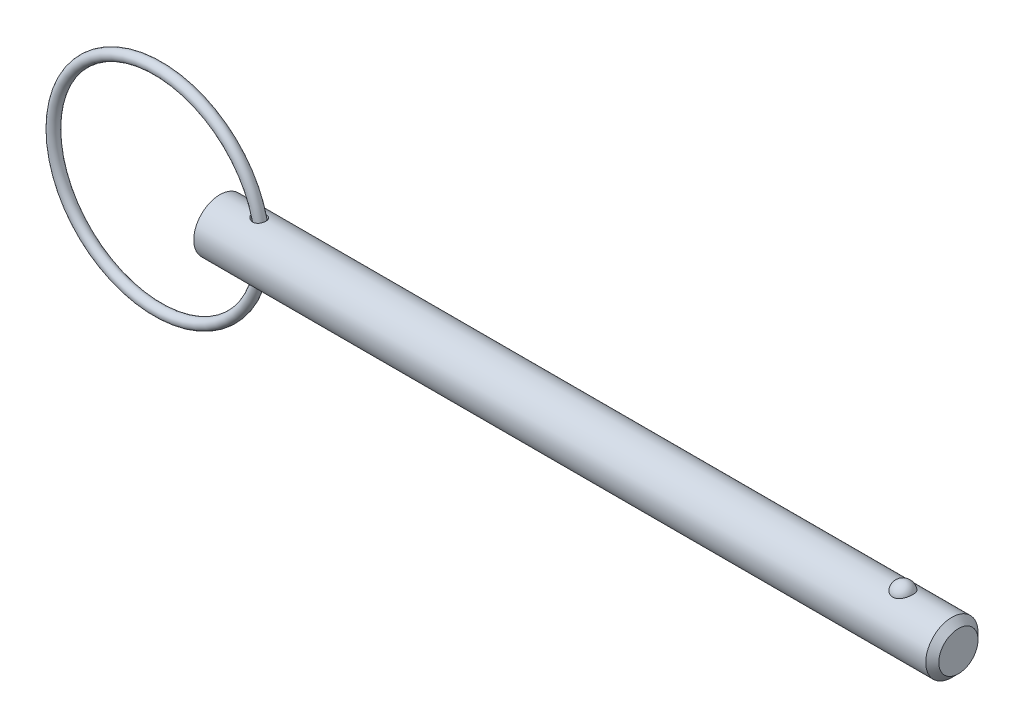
ISO-10303-21;
HEADER;
FILE_DESCRIPTION(('STEP AP214'),'2;1');
FILE_NAME('part.step','',(''),(''),'','','');
FILE_SCHEMA(('AUTOMOTIVE_DESIGN { 1 0 10303 214 1 1 1 1 }'));
ENDSEC;
DATA;
#1=APPLICATION_CONTEXT('core data for automotive mechanical design processes');
#2=APPLICATION_PROTOCOL_DEFINITION('international standard','automotive_design',2000,#1);
#3=PRODUCT_CONTEXT('',#1,'mechanical');
#4=PRODUCT('Part','Part','',(#3));
#5=PRODUCT_RELATED_PRODUCT_CATEGORY('part','',(#4));
#6=PRODUCT_DEFINITION_FORMATION('','',#4);
#7=PRODUCT_DEFINITION_CONTEXT('part definition',#1,'design');
#8=PRODUCT_DEFINITION('design','',#6,#7);
#9=PRODUCT_DEFINITION_SHAPE('','',#8);
#10=(LENGTH_UNIT() NAMED_UNIT(*) SI_UNIT(.MILLI.,.METRE.));
#11=(NAMED_UNIT(*) PLANE_ANGLE_UNIT() SI_UNIT($,.RADIAN.));
#12=(NAMED_UNIT(*) SI_UNIT($,.STERADIAN.) SOLID_ANGLE_UNIT());
#13=UNCERTAINTY_MEASURE_WITH_UNIT(LENGTH_MEASURE(1.E-05),#10,'distance_accuracy_value','');
#14=(GEOMETRIC_REPRESENTATION_CONTEXT(3) GLOBAL_UNCERTAINTY_ASSIGNED_CONTEXT((#13)) GLOBAL_UNIT_ASSIGNED_CONTEXT((#10,
#11,#12)) REPRESENTATION_CONTEXT('',''));
#15=CARTESIAN_POINT('',(0.,0.,0.));
#16=DIRECTION('',(0.,0.,1.));
#17=DIRECTION('',(1.,0.,0.));
#18=AXIS2_PLACEMENT_3D('',#15,#16,#17);
#19=CARTESIAN_POINT('',(-7.52490236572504,0.,0.));
#20=DIRECTION('',(0.,0.,1.));
#21=DIRECTION('',(1.,0.,0.));
#22=AXIS2_PLACEMENT_3D('',#19,#20,#21);
#23=TOROIDAL_SURFACE('',#22,12.7,0.635000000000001);
#24=CARTESIAN_POINT('',(5.81009763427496,0.,0.));
#25=VERTEX_POINT('',#24);
#26=VERTEX_LOOP('',#25);
#27=FACE_BOUND('',#26,.T.);
#28=ADVANCED_FACE('P0_F12',(#27),#23,.T.);
#29=CLOSED_SHELL('',(#28));
#30=MANIFOLD_SOLID_BREP('P0_B1',#29);
#31=CARTESIAN_POINT('',(0.,0.,0.));
#32=DIRECTION('',(1.,0.,0.));
#33=DIRECTION('',(0.,0.,-1.));
#34=AXIS2_PLACEMENT_3D('',#31,#32,#33);
#35=CYLINDRICAL_SURFACE('',#34,3.175);
#36=CARTESIAN_POINT('',(4.01221718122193,3.16142308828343,-0.293307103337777));
#37=CARTESIAN_POINT('',(4.03067993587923,3.15750982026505,-0.335477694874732));
#38=CARTESIAN_POINT('',(4.05297703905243,3.15289835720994,-0.375943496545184));
#39=CARTESIAN_POINT('',(4.10415276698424,3.14284099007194,-0.452407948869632));
#40=CARTESIAN_POINT('',(4.1330447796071,3.13739339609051,-0.488397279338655));
#41=CARTESIAN_POINT('',(4.19615348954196,3.12629932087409,-0.554988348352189));
#42=CARTESIAN_POINT('',(4.23034557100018,3.12065384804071,-0.585613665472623));
#43=CARTESIAN_POINT('',(4.3031328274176,3.10972452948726,-0.641123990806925));
#44=CARTESIAN_POINT('',(4.34172706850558,3.10444060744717,-0.666010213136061));
#45=CARTESIAN_POINT('',(4.42517725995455,3.09444053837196,-0.711079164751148));
#46=CARTESIAN_POINT('',(4.47028158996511,3.08978882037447,-0.730818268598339));
#47=CARTESIAN_POINT('',(4.56327045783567,3.08209858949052,-0.762602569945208));
#48=CARTESIAN_POINT('',(4.61115533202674,3.07906027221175,-0.774646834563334));
#49=CARTESIAN_POINT('',(4.70827322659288,3.0750396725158,-0.790458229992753));
#50=CARTESIAN_POINT('',(4.75750323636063,3.07405312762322,-0.79424252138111));
#51=CARTESIAN_POINT('',(4.85586074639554,3.07433427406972,-0.793155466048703));
#52=CARTESIAN_POINT('',(4.90498828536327,3.07560084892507,-0.788288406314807));
#53=CARTESIAN_POINT('',(4.99830385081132,3.08013122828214,-0.770385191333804));
#54=CARTESIAN_POINT('',(5.04260499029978,3.08325928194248,-0.757902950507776));
#55=CARTESIAN_POINT('',(5.1282462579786,3.09104671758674,-0.725486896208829));
#56=CARTESIAN_POINT('',(5.16958706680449,3.09570574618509,-0.705554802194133));
#57=CARTESIAN_POINT('',(5.24627719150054,3.10576748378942,-0.65981371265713));
#58=CARTESIAN_POINT('',(5.28181038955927,3.11112830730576,-0.634302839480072));
#59=CARTESIAN_POINT('',(5.34802604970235,3.12213947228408,-0.57766778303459));
#60=CARTESIAN_POINT('',(5.37870854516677,3.1277898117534,-0.546543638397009));
#61=CARTESIAN_POINT('',(5.43445707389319,3.13876145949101,-0.479533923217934));
#62=CARTESIAN_POINT('',(5.45951927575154,3.14408254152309,-0.443645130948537));
#63=CARTESIAN_POINT('',(5.50339935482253,3.15381660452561,-0.368122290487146));
#64=CARTESIAN_POINT('',(5.52221691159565,3.15822953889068,-0.328488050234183));
#65=CARTESIAN_POINT('',(5.55335622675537,3.16572312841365,-0.246075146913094));
#66=CARTESIAN_POINT('',(5.56559711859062,3.16878711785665,-0.203264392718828));
#67=CARTESIAN_POINT('',(5.58294807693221,3.17317503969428,-0.116135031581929));
#68=CARTESIAN_POINT('',(5.58805800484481,3.17449893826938,-0.0718163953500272));
#69=CARTESIAN_POINT('',(5.59103306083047,3.17526647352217,0.01723401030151));
#70=CARTESIAN_POINT('',(5.58887304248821,3.17470358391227,0.0619666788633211));
#71=CARTESIAN_POINT('',(5.57730300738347,3.17174350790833,0.15042284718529));
#72=CARTESIAN_POINT('',(5.56789286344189,3.16934628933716,0.1941463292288));
#73=CARTESIAN_POINT('',(5.54204285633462,3.16297605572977,0.27934466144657));
#74=CARTESIAN_POINT('',(5.52560272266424,3.15900298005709,0.320819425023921));
#75=CARTESIAN_POINT('',(5.4860820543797,3.14991364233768,0.400340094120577));
#76=CARTESIAN_POINT('',(5.46300145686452,3.14479736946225,0.438385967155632));
#77=CARTESIAN_POINT('',(5.41080575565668,3.1339965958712,0.509900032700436));
#78=CARTESIAN_POINT('',(5.3817004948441,3.12831302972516,0.54337554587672));
#79=CARTESIAN_POINT('',(5.31818122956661,3.11701107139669,0.604852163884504));
#80=CARTESIAN_POINT('',(5.2837678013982,3.11139267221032,0.632853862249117));
#81=CARTESIAN_POINT('',(5.21096127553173,3.10091904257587,0.682320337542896));
#82=CARTESIAN_POINT('',(5.1726139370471,3.09605639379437,0.703850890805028));
#83=CARTESIAN_POINT('',(5.09274050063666,3.08756769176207,0.740203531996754));
#84=CARTESIAN_POINT('',(5.05121474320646,3.08394150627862,0.755026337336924));
#85=CARTESIAN_POINT('',(4.96650658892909,3.07833156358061,0.777582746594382));
#86=CARTESIAN_POINT('',(4.92333841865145,3.07633606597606,0.785367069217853));
#87=CARTESIAN_POINT('',(4.83627503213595,3.07411756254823,0.794006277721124));
#88=CARTESIAN_POINT('',(4.79237971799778,3.07389479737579,0.794860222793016));
#89=CARTESIAN_POINT('',(4.70375644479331,3.0752087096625,0.789761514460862));
#90=CARTESIAN_POINT('',(4.65904075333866,3.07679607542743,0.783612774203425));
#91=CARTESIAN_POINT('',(4.57116325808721,3.08158486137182,0.764561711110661));
#92=CARTESIAN_POINT('',(4.52800197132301,3.08478681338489,0.751657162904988));
#93=CARTESIAN_POINT('',(4.44149370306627,3.09268658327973,0.718486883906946));
#94=CARTESIAN_POINT('',(4.39831651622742,3.0974680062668,0.697797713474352));
#95=CARTESIAN_POINT('',(4.31591226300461,3.10789270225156,0.649792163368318));
#96=CARTESIAN_POINT('',(4.27668695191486,3.11353635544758,0.622472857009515));
#97=CARTESIAN_POINT('',(4.20182407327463,3.1252888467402,0.560557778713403));
#98=CARTESIAN_POINT('',(4.16638921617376,3.13140725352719,0.525717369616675));
#99=CARTESIAN_POINT('',(4.10227951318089,3.14315144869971,0.450199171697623));
#100=CARTESIAN_POINT('',(4.0736023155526,3.14877740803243,0.409523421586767));
#101=CARTESIAN_POINT('',(4.02575866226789,3.15851130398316,0.325741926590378));
#102=CARTESIAN_POINT('',(4.00615248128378,3.16268619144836,0.282896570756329));
#103=CARTESIAN_POINT('',(3.97532986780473,3.16936826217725,0.1941636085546));
#104=CARTESIAN_POINT('',(3.96410589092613,3.17187694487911,0.148278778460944));
#105=CARTESIAN_POINT('',(3.95155037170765,3.17469339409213,0.0604600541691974));
#106=CARTESIAN_POINT('',(3.9492378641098,3.17521926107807,0.0186712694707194));
#107=CARTESIAN_POINT('',(3.95191506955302,3.1746144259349,-0.0646295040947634));
#108=CARTESIAN_POINT('',(3.9568961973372,3.17348567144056,-0.106141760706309));
#109=CARTESIAN_POINT('',(3.97060099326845,3.17043701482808,-0.172031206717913));
#110=CARTESIAN_POINT('',(3.97717137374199,3.16898333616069,-0.196902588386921));
#111=CARTESIAN_POINT('',(3.99283717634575,3.16556630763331,-0.245794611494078));
#112=CARTESIAN_POINT('',(4.00193224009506,3.16360303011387,-0.269815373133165));
#113=CARTESIAN_POINT('',(4.01221718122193,3.16142308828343,-0.293307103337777));
#114=B_SPLINE_CURVE_WITH_KNOTS('',3,(#36,#37,#38,#39,#40,#41,#42,#43,#44,#45,#46,#47,#48,#49,
#50,#51,#52,#53,#54,#55,#56,#57,#58,#59,#60,#61,#62,#63,#64,#65,#66,#67,#68,#69,#70,#71,#72,#73,
#74,#75,#76,#77,#78,#79,#80,#81,#82,#83,#84,#85,#86,#87,#88,#89,#90,#91,#92,#93,#94,#95,#96,#97,
#98,#99,#100,#101,#102,#103,#104,#105,#106,#107,#108,#109,#110,#111,#112,#113),.UNSPECIFIED.,
.T.,.F.,(4,2,2,2,2,2,2,2,2,2,2,2,2,2,2,2,2,2,2,2,2,2,2,2,2,2,2,2,2,2,2,2,2,2,2,2,2,2,4),(0.,
0.138498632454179,0.277280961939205,0.41543703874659,0.553563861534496,0.701231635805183,
0.848917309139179,0.996295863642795,1.14360140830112,1.28129260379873,1.41895203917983,
1.55053732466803,1.68212170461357,1.81379551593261,1.94547608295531,2.07874074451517,
2.21200799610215,2.34573668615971,2.47946772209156,2.61320390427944,2.74694135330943,
2.8804620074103,3.01396817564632,3.14606745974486,3.27815261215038,3.40927820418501,
3.54042159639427,3.6753294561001,3.81028178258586,3.95399377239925,4.09776931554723,
4.24721954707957,4.39661769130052,4.53771923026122,4.67869361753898,4.80361432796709,
4.92838811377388,5.00555170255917,5.08270434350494),.UNSPECIFIED.);
#115=CARTESIAN_POINT('',(4.01221718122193,3.16142308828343,-0.293307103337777));
#116=VERTEX_POINT('',#115);
#117=EDGE_CURVE('P1_E40',#116,#116,#114,.T.);
#118=ORIENTED_EDGE('',*,*,#117,.T.);
#119=EDGE_LOOP('',(#118));
#120=FACE_BOUND('',#119,.T.);
#121=CARTESIAN_POINT('',(88.91625,0.,0.));
#122=DIRECTION('',(1.,0.,0.));
#123=DIRECTION('',(0.,0.,-1.));
#124=AXIS2_PLACEMENT_3D('',#121,#122,#123);
#125=CIRCLE('',#124,3.175);
#126=CARTESIAN_POINT('',(88.91625,0.,-3.175));
#127=VERTEX_POINT('',#126);
#128=EDGE_CURVE('P1_E25',#127,#127,#125,.T.);
#129=ORIENTED_EDGE('',*,*,#128,.F.);
#130=EDGE_LOOP('',(#129));
#131=FACE_BOUND('',#130,.T.);
#132=CARTESIAN_POINT('',(0.,0.,0.));
#133=DIRECTION('',(1.,0.,0.));
#134=DIRECTION('',(0.,0.,-1.));
#135=AXIS2_PLACEMENT_3D('',#132,#133,#134);
#136=CIRCLE('',#135,3.175);
#137=CARTESIAN_POINT('',(0.,0.,-3.175));
#138=VERTEX_POINT('',#137);
#139=EDGE_CURVE('P1_E9',#138,#138,#136,.T.);
#140=ORIENTED_EDGE('',*,*,#139,.T.);
#141=EDGE_LOOP('',(#140));
#142=FACE_BOUND('',#141,.T.);
#143=CARTESIAN_POINT('',(82.9757276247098,2.92898950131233,1.2254164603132));
#144=CARTESIAN_POINT('',(82.912316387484,2.92899434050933,1.22541146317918));
#145=CARTESIAN_POINT('',(82.8487979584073,2.93112688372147,1.2203464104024));
#146=CARTESIAN_POINT('',(82.7235306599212,2.93942752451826,1.20020949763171));
#147=CARTESIAN_POINT('',(82.6617869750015,2.9456063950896,1.1851109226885));
#148=CARTESIAN_POINT('',(82.5420651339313,2.96127115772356,1.14540352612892));
#149=CARTESIAN_POINT('',(82.4840775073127,2.97074831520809,1.12081980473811));
#150=CARTESIAN_POINT('',(82.3731943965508,2.99197584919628,1.06285154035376));
#151=CARTESIAN_POINT('',(82.3202966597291,3.0037252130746,1.02947091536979));
#152=CARTESIAN_POINT('',(82.2192688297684,3.02865714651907,0.953674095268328));
#153=CARTESIAN_POINT('',(82.1713240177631,3.04187163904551,0.91102165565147));
#154=CARTESIAN_POINT('',(82.0830360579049,3.06808741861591,0.818400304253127));
#155=CARTESIAN_POINT('',(82.0426952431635,3.08108863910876,0.768429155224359));
#156=CARTESIAN_POINT('',(81.9688039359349,3.10614903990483,0.660064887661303));
#157=CARTESIAN_POINT('',(81.9356330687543,3.11814104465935,0.601396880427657));
#158=CARTESIAN_POINT('',(81.8791190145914,3.13926931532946,0.47902691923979));
#159=CARTESIAN_POINT('',(81.8557764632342,3.14840539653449,0.415324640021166));
#160=CARTESIAN_POINT('',(81.8191785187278,3.16298160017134,0.283885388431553));
#161=CARTESIAN_POINT('',(81.8060407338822,3.16837855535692,0.216110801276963));
#162=CARTESIAN_POINT('',(81.7905676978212,3.17475386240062,0.0791367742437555));
#163=CARTESIAN_POINT('',(81.788232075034,3.17573236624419,0.0099373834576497));
#164=CARTESIAN_POINT('',(81.7943886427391,3.17318075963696,-0.127420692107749));
#165=CARTESIAN_POINT('',(81.8028073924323,3.16968122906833,-0.195583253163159));
#166=CARTESIAN_POINT('',(81.8301752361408,3.1585790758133,-0.329413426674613));
#167=CARTESIAN_POINT('',(81.8491245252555,3.15097637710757,-0.395080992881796));
#168=CARTESIAN_POINT('',(81.8972057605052,3.13242485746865,-0.5221806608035));
#169=CARTESIAN_POINT('',(81.9263524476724,3.12147119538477,-0.583606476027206));
#170=CARTESIAN_POINT('',(81.9942352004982,3.09734973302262,-0.700436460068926));
#171=CARTESIAN_POINT('',(82.032972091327,3.08418174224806,-0.755840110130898));
#172=CARTESIAN_POINT('',(82.1194771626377,3.05694884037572,-0.85940454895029));
#173=CARTESIAN_POINT('',(82.1672961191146,3.04287919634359,-0.907521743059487));
#174=CARTESIAN_POINT('',(82.2707353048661,3.01548927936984,-0.99475883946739));
#175=CARTESIAN_POINT('',(82.3263549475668,3.0021689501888,-1.03387941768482));
#176=CARTESIAN_POINT('',(82.4428093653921,2.97810316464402,-1.10126594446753));
#177=CARTESIAN_POINT('',(82.5035182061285,2.96731170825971,-1.12973256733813));
#178=CARTESIAN_POINT('',(82.6293712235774,2.94928934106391,-1.17598467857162));
#179=CARTESIAN_POINT('',(82.6945137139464,2.94205708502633,-1.19377420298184));
#180=CARTESIAN_POINT('',(82.8238562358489,2.93233065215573,-1.21746387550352));
#181=CARTESIAN_POINT('',(82.8879385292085,2.92961621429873,-1.22391763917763));
#182=CARTESIAN_POINT('',(83.0163375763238,2.92855752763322,-1.22644976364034));
#183=CARTESIAN_POINT('',(83.0806542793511,2.93021238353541,-1.22253024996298));
#184=CARTESIAN_POINT('',(83.2055239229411,2.9375685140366,-1.20474140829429));
#185=CARTESIAN_POINT('',(83.266131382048,2.94313790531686,-1.19119621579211));
#186=CARTESIAN_POINT('',(83.3841106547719,2.95756226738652,-1.15491492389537));
#187=CARTESIAN_POINT('',(83.4414822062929,2.96641750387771,-1.13217808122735));
#188=CARTESIAN_POINT('',(83.5527699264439,2.98669918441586,-1.07755083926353));
#189=CARTESIAN_POINT('',(83.6065845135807,2.9981771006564,-1.0454730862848));
#190=CARTESIAN_POINT('',(83.708147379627,3.02240235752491,-0.973220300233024));
#191=CARTESIAN_POINT('',(83.7558942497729,3.03514999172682,-0.933043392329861));
#192=CARTESIAN_POINT('',(83.8465817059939,3.06131230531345,-0.843372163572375));
#193=CARTESIAN_POINT('',(83.8891588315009,3.07472822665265,-0.79351033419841));
#194=CARTESIAN_POINT('',(83.9656765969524,3.10021106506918,-0.687241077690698));
#195=CARTESIAN_POINT('',(83.9996156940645,3.1122777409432,-0.630832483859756));
#196=CARTESIAN_POINT('',(84.0591209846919,3.134208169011,-0.511059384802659));
#197=CARTESIAN_POINT('',(84.0843892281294,3.14399040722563,-0.447531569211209));
#198=CARTESIAN_POINT('',(84.1245117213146,3.15983820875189,-0.316827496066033));
#199=CARTESIAN_POINT('',(84.1393659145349,3.16590375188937,-0.249651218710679));
#200=CARTESIAN_POINT('',(84.158358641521,3.17370076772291,-0.113549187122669));
#201=CARTESIAN_POINT('',(84.1624966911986,3.17543204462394,-0.0446233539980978));
#202=CARTESIAN_POINT('',(84.1599697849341,3.17438372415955,0.0929938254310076));
#203=CARTESIAN_POINT('',(84.1533050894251,3.17160423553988,0.161685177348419));
#204=CARTESIAN_POINT('',(84.1293754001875,3.1618438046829,0.296502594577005));
#205=CARTESIAN_POINT('',(84.1121674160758,3.15488546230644,0.36264043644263));
#206=CARTESIAN_POINT('',(84.0675470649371,3.13748892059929,0.490896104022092));
#207=CARTESIAN_POINT('',(84.0401339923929,3.12705048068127,0.553013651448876));
#208=CARTESIAN_POINT('',(83.9754626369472,3.10369139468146,0.671876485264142));
#209=CARTESIAN_POINT('',(83.9381467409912,3.0907563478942,0.728587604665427));
#210=CARTESIAN_POINT('',(83.8545246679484,3.06381731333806,0.834653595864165));
#211=CARTESIAN_POINT('',(83.8082189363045,3.04981337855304,0.884008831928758));
#212=CARTESIAN_POINT('',(83.707718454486,3.02230423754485,0.97391679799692));
#213=CARTESIAN_POINT('',(83.653535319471,3.00879833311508,1.01448227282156));
#214=CARTESIAN_POINT('',(83.5385299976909,2.98383625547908,1.0857155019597));
#215=CARTESIAN_POINT('',(83.4777053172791,2.9723808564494,1.11637952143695));
#216=CARTESIAN_POINT('',(83.3533690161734,2.95329063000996,1.16592590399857));
#217=CARTESIAN_POINT('',(83.2900230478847,2.9455373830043,1.18517901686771));
#218=CARTESIAN_POINT('',(83.1607664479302,2.9342556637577,1.21284802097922));
#219=CARTESIAN_POINT('',(83.0948641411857,2.93071450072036,1.2212964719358));
#220=CARTESIAN_POINT('',(83.011116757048,2.9291525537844,1.22502505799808));
#221=CARTESIAN_POINT('',(82.9934263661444,2.92898815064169,1.22541785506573));
#222=CARTESIAN_POINT('',(82.9757276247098,2.92898950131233,1.2254164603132));
#223=B_SPLINE_CURVE_WITH_KNOTS('',3,(#143,#144,#145,#146,#147,#148,#149,#150,#151,#152,#153,
#154,#155,#156,#157,#158,#159,#160,#161,#162,#163,#164,#165,#166,#167,#168,#169,#170,#171,#172,
#173,#174,#175,#176,#177,#178,#179,#180,#181,#182,#183,#184,#185,#186,#187,#188,#189,#190,#191,
#192,#193,#194,#195,#196,#197,#198,#199,#200,#201,#202,#203,#204,#205,#206,#207,#208,#209,#210,
#211,#212,#213,#214,#215,#216,#217,#218,#219,#220,#221,#222),.UNSPECIFIED.,.T.,.F.,(4,2,2,2,2,2,
2,2,2,2,2,2,2,2,2,2,2,2,2,2,2,2,2,2,2,2,2,2,2,2,2,2,2,2,2,2,2,2,2,4),(0.,0.190186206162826,
0.380880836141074,0.571074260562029,0.761183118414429,0.956866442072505,1.15260970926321,
1.35701770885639,1.56143892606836,1.76818248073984,1.97491892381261,2.18025109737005,
2.38558707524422,2.59122111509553,2.79687285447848,3.00371012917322,3.21053185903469,
3.41323429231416,3.61586005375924,3.80828192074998,4.00066436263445,4.18685798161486,
4.37306665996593,4.56330302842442,4.75358348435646,4.95345287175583,5.15335793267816,
5.35957003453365,5.56578325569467,5.7720057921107,5.97822335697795,6.18333558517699,
6.38846199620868,6.59480900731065,6.80114579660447,7.00718137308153,7.21329457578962,
7.41228022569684,7.61066481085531,7.66374777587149),.UNSPECIFIED.);
#224=CARTESIAN_POINT('',(82.9757276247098,2.92898950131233,1.2254164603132));
#225=VERTEX_POINT('',#224);
#226=EDGE_CURVE('P1_E34',#225,#225,#223,.T.);
#227=ORIENTED_EDGE('',*,*,#226,.T.);
#228=EDGE_LOOP('',(#227));
#229=FACE_BOUND('',#228,.T.);
#230=CARTESIAN_POINT('',(4.01221718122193,-3.16142308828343,-0.293307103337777));
#231=CARTESIAN_POINT('',(3.99616924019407,-3.16482429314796,-0.256648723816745));
#232=CARTESIAN_POINT('',(3.9830087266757,-3.16769953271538,-0.218679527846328));
#233=CARTESIAN_POINT('',(3.96305928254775,-3.17210414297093,-0.141027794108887));
#234=CARTESIAN_POINT('',(3.95626715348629,-3.17363418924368,-0.101346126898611));
#235=CARTESIAN_POINT('',(3.94940055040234,-3.17518116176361,-0.0213063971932));
#236=CARTESIAN_POINT('',(3.94933713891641,-3.17519559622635,0.0190526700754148));
#237=CARTESIAN_POINT('',(3.95595884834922,-3.173703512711,0.0991848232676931));
#238=CARTESIAN_POINT('',(3.96264478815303,-3.17219681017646,0.138957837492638));
#239=CARTESIAN_POINT('',(3.98225001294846,-3.16786598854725,0.216153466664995));
#240=CARTESIAN_POINT('',(3.99506606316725,-3.16506371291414,0.253603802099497));
#241=CARTESIAN_POINT('',(4.0263107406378,-3.15843101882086,0.325977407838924));
#242=CARTESIAN_POINT('',(4.04474073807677,-3.15460034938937,0.360900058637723));
#243=CARTESIAN_POINT('',(4.0879644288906,-3.14597426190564,0.429836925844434));
#244=CARTESIAN_POINT('',(4.1131071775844,-3.1411307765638,0.463625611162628));
#245=CARTESIAN_POINT('',(4.16818460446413,-3.13112506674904,0.526983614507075));
#246=CARTESIAN_POINT('',(4.1981214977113,-3.1259626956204,0.556550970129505));
#247=CARTESIAN_POINT('',(4.26550089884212,-3.11521604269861,0.614003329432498));
#248=CARTESIAN_POINT('',(4.3034063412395,-3.10964747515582,0.641349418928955));
#249=CARTESIAN_POINT('',(4.38313680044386,-3.09926692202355,0.68977116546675));
#250=CARTESIAN_POINT('',(4.42496355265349,-3.09445527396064,0.710844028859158));
#251=CARTESIAN_POINT('',(4.51417855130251,-3.08586578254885,0.747282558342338));
#252=CARTESIAN_POINT('',(4.56175044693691,-3.08216903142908,0.762221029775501));
#253=CARTESIAN_POINT('',(4.6588493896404,-3.076742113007,0.783842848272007));
#254=CARTESIAN_POINT('',(4.70837600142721,-3.07501151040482,0.790528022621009));
#255=CARTESIAN_POINT('',(4.80630979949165,-3.07383938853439,0.7950736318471));
#256=CARTESIAN_POINT('',(4.85470314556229,-3.07432752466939,0.793205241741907));
#257=CARTESIAN_POINT('',(4.95034305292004,-3.07744489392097,0.781023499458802));
#258=CARTESIAN_POINT('',(4.99759012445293,-3.0800731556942,0.770713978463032));
#259=CARTESIAN_POINT('',(5.08626194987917,-3.08693276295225,0.742738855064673));
#260=CARTESIAN_POINT('',(5.1278649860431,-3.09104603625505,0.725607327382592));
#261=CARTESIAN_POINT('',(5.20739903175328,-3.10040746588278,0.684500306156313));
#262=CARTESIAN_POINT('',(5.24533051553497,-3.10565547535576,0.660525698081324));
#263=CARTESIAN_POINT('',(5.31542898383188,-3.11652031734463,0.607160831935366));
#264=CARTESIAN_POINT('',(5.34772618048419,-3.12212297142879,0.577938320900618));
#265=CARTESIAN_POINT('',(5.40696901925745,-3.13320503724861,0.51447712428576));
#266=CARTESIAN_POINT('',(5.43391452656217,-3.13868444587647,0.48023831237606));
#267=CARTESIAN_POINT('',(5.4820017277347,-3.14897211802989,0.407384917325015));
#268=CARTESIAN_POINT('',(5.50309185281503,-3.15377424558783,0.368735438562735));
#269=CARTESIAN_POINT('',(5.53866240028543,-3.16213411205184,0.288380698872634));
#270=CARTESIAN_POINT('',(5.55314252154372,-3.16569179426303,0.246675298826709));
#271=CARTESIAN_POINT('',(5.57526489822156,-3.17121134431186,0.160950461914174));
#272=CARTESIAN_POINT('',(5.58283917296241,-3.17315732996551,0.116912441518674));
#273=CARTESIAN_POINT('',(5.59072863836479,-3.17518554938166,0.0281485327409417));
#274=CARTESIAN_POINT('',(5.59104374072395,-3.17526776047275,-0.016577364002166));
#275=CARTESIAN_POINT('',(5.58440302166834,-3.17355847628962,-0.105510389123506));
#276=CARTESIAN_POINT('',(5.57743745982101,-3.17176447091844,-0.149716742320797));
#277=CARTESIAN_POINT('',(5.55638330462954,-3.16649194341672,-0.23629572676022));
#278=CARTESIAN_POINT('',(5.54229454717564,-3.16301338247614,-0.278668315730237));
#279=CARTESIAN_POINT('',(5.50732506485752,-3.15474878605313,-0.360378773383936));
#280=CARTESIAN_POINT('',(5.48644386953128,-3.14996266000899,-0.399716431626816));
#281=CARTESIAN_POINT('',(5.43839310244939,-3.13960947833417,-0.47422997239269));
#282=CARTESIAN_POINT('',(5.41122365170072,-3.1340424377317,-0.509405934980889));
#283=CARTESIAN_POINT('',(5.35140258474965,-3.12277449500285,-0.574449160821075));
#284=CARTESIAN_POINT('',(5.31877354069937,-3.11707422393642,-0.604337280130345));
#285=CARTESIAN_POINT('',(5.24883067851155,-3.10616541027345,-0.658116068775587));
#286=CARTESIAN_POINT('',(5.21151752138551,-3.1009567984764,-0.682007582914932));
#287=CARTESIAN_POINT('',(5.13375489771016,-3.09168295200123,-0.722881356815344));
#288=CARTESIAN_POINT('',(5.09335030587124,-3.0876042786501,-0.739946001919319));
#289=CARTESIAN_POINT('',(5.0101742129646,-3.08094605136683,-0.767199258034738));
#290=CARTESIAN_POINT('',(4.96740279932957,-3.07836644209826,-0.777388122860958));
#291=CARTESIAN_POINT('',(4.88066362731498,-3.07495302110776,-0.790782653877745));
#292=CARTESIAN_POINT('',(4.8366943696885,-3.07412150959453,-0.793979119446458));
#293=CARTESIAN_POINT('',(4.74880185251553,-3.07424620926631,-0.793495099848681));
#294=CARTESIAN_POINT('',(4.70487860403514,-3.07520278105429,-0.789813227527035));
#295=CARTESIAN_POINT('',(4.61626456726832,-3.07882608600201,-0.775571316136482));
#296=CARTESIAN_POINT('',(4.571624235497,-3.08156578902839,-0.764717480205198));
#297=CARTESIAN_POINT('',(4.48464592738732,-3.08847909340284,-0.736297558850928));
#298=CARTESIAN_POINT('',(4.44230893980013,-3.09265330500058,-0.718728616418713));
#299=CARTESIAN_POINT('',(4.35823256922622,-3.10228551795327,-0.675988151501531));
#300=CARTESIAN_POINT('',(4.31671586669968,-3.10780992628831,-0.650392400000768));
#301=CARTESIAN_POINT('',(4.23853942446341,-3.11932897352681,-0.592684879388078));
#302=CARTESIAN_POINT('',(4.20188053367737,-3.12532369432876,-0.560571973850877));
#303=CARTESIAN_POINT('',(4.13583653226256,-3.13687565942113,-0.491740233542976));
#304=CARTESIAN_POINT('',(4.10623659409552,-3.14244088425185,-0.455229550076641));
#305=CARTESIAN_POINT('',(4.05384351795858,-3.1527191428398,-0.377513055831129));
#306=CARTESIAN_POINT('',(4.03104346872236,-3.1574330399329,-0.336312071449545));
#307=CARTESIAN_POINT('',(4.01221718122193,-3.16142308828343,-0.293307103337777));
#308=B_SPLINE_CURVE_WITH_KNOTS('',3,(#230,#231,#232,#233,#234,#235,#236,#237,#238,#239,#240,
#241,#242,#243,#244,#245,#246,#247,#248,#249,#250,#251,#252,#253,#254,#255,#256,#257,#258,#259,
#260,#261,#262,#263,#264,#265,#266,#267,#268,#269,#270,#271,#272,#273,#274,#275,#276,#277,#278,
#279,#280,#281,#282,#283,#284,#285,#286,#287,#288,#289,#290,#291,#292,#293,#294,#295,#296,#297,
#298,#299,#300,#301,#302,#303,#304,#305,#306,#307),.UNSPECIFIED.,.T.,.F.,(4,2,2,2,2,2,2,2,2,2,2,
2,2,2,2,2,2,2,2,2,2,2,2,2,2,2,2,2,2,2,2,2,2,2,2,2,2,2,4),(0.,0.120338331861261,
0.240616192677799,0.361091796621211,0.481582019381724,0.600110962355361,0.718668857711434,
0.845336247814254,0.972062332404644,1.1126676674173,1.25333552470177,1.40259505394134,
1.55182153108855,1.69635040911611,1.84081372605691,1.97568175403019,2.11053233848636,
2.24166080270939,2.37279256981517,2.50504501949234,2.63730349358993,2.77085027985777,
2.90439869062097,3.03812599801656,3.17185638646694,3.30559603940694,3.43933311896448,
3.57253035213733,3.70570880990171,3.83722775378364,3.96874184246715,4.10042887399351,
4.23214246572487,4.36961700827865,4.5071501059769,4.65373408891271,4.8003436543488,
4.94166003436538,5.08283228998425),.UNSPECIFIED.);
#309=CARTESIAN_POINT('',(4.01221718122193,-3.16142308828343,-0.293307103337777));
#310=VERTEX_POINT('',#309);
#311=EDGE_CURVE('P1_E17',#310,#310,#308,.T.);
#312=ORIENTED_EDGE('',*,*,#311,.T.);
#313=EDGE_LOOP('',(#312));
#314=FACE_BOUND('',#313,.T.);
#315=ADVANCED_FACE('P1_F13',(#120,#131,#142,#229,#314),#35,.T.);
#316=CARTESIAN_POINT('',(0.,0.,0.));
#317=DIRECTION('',(-1.,0.,0.));
#318=DIRECTION('',(0.,0.,1.));
#319=AXIS2_PLACEMENT_3D('',#316,#317,#318);
#320=PLANE('',#319);
#321=ORIENTED_EDGE('',*,*,#139,.F.);
#322=EDGE_LOOP('',(#321));
#323=FACE_BOUND('',#322,.T.);
#324=ADVANCED_FACE('P1_F15',(#323),#320,.T.);
#325=CARTESIAN_POINT('',(89.71,0.,0.));
#326=DIRECTION('',(-1.,0.,0.));
#327=DIRECTION('',(0.,0.,1.));
#328=AXIS2_PLACEMENT_3D('',#325,#326,#327);
#329=CONICAL_SURFACE('',#328,2.38125000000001,0.785398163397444);
#330=ORIENTED_EDGE('',*,*,#128,.T.);
#331=EDGE_LOOP('',(#330));
#332=FACE_BOUND('',#331,.T.);
#333=CARTESIAN_POINT('',(89.71,0.,0.));
#334=DIRECTION('',(1.,0.,0.));
#335=DIRECTION('',(0.,0.,-1.));
#336=AXIS2_PLACEMENT_3D('',#333,#334,#335);
#337=CIRCLE('',#336,2.38125000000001);
#338=CARTESIAN_POINT('',(89.71,0.,-2.38125000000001));
#339=VERTEX_POINT('',#338);
#340=EDGE_CURVE('P1_E30',#339,#339,#337,.T.);
#341=ORIENTED_EDGE('',*,*,#340,.F.);
#342=EDGE_LOOP('',(#341));
#343=FACE_BOUND('',#342,.T.);
#344=ADVANCED_FACE('P1_F55',(#332,#343),#329,.T.);
#345=CARTESIAN_POINT('',(89.71,2.38125000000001,0.));
#346=DIRECTION('',(1.,0.,0.));
#347=DIRECTION('',(0.,0.,-1.));
#348=AXIS2_PLACEMENT_3D('',#345,#346,#347);
#349=PLANE('',#348);
#350=ORIENTED_EDGE('',*,*,#340,.T.);
#351=EDGE_LOOP('',(#350));
#352=FACE_BOUND('',#351,.T.);
#353=ADVANCED_FACE('P1_F51',(#352),#349,.T.);
#354=CARTESIAN_POINT('',(82.9757276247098,2.8575,0.));
#355=DIRECTION('',(-1.,0.,0.));
#356=DIRECTION('',(0.,1.,0.));
#357=AXIS2_PLACEMENT_3D('',#354,#355,#356);
#358=SPHERICAL_SURFACE('',#357,1.22750000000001);
#359=ORIENTED_EDGE('',*,*,#226,.F.);
#360=EDGE_LOOP('',(#359));
#361=FACE_BOUND('',#360,.T.);
#362=ADVANCED_FACE('P1_F46',(#361),#358,.T.);
#363=CARTESIAN_POINT('',(-7.52490236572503,0.,0.));
#364=DIRECTION('',(0.,0.,1.));
#365=DIRECTION('',(1.,0.,0.));
#366=AXIS2_PLACEMENT_3D('',#363,#364,#365);
#367=TOROIDAL_SURFACE('',#366,12.7,0.79375);
#368=ORIENTED_EDGE('',*,*,#311,.F.);
#369=EDGE_LOOP('',(#368));
#370=FACE_BOUND('',#369,.T.);
#371=ORIENTED_EDGE('',*,*,#117,.F.);
#372=EDGE_LOOP('',(#371));
#373=FACE_BOUND('',#372,.T.);
#374=ADVANCED_FACE('P1_F50',(#370,#373),#367,.F.);
#375=CLOSED_SHELL('',(#315,#324,#344,#353,#362,#374));
#376=MANIFOLD_SOLID_BREP('P1_B1',#375);
#377=ADVANCED_BREP_SHAPE_REPRESENTATION('',(#18,#30,#376),#14);
#378=SHAPE_DEFINITION_REPRESENTATION(#9,#377);
ENDSEC;
END-ISO-10303-21;
